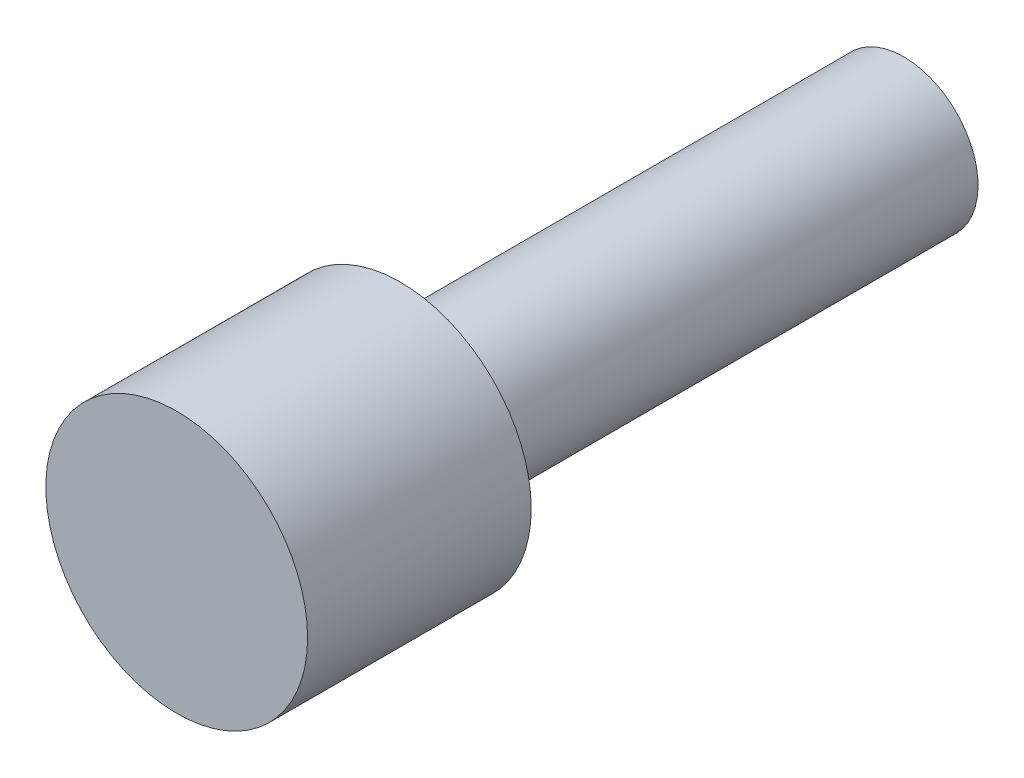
from build123d import *

# Parameters (mm, degrees)
SKETCH1_R           = 7.2
BOSS_EXTRUDE1_DEPTH = 12.299998
SKETCH2_R           = 4.08
BOSS_EXTRUDE2_DEPTH = 27.700001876


with BuildPart() as part:
    # Sketch1 → Boss-Extrude1 (new body)
    with BuildSketch(Plane.XY):
        Circle(SKETCH1_R)
    extrude(amount=-BOSS_EXTRUDE1_DEPTH)

    # Sketch2 → Boss-Extrude2 (add)
    with BuildSketch(Plane(origin=(0, 0, -12.299998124), x_dir=(-1, 0, 0), z_dir=(0, 0, -1))):
        with Locations(Location((0, 0, 0), (0, 0, 90))):
            Circle(SKETCH2_R)
    extrude(amount=BOSS_EXTRUDE2_DEPTH)


solid = part.part
